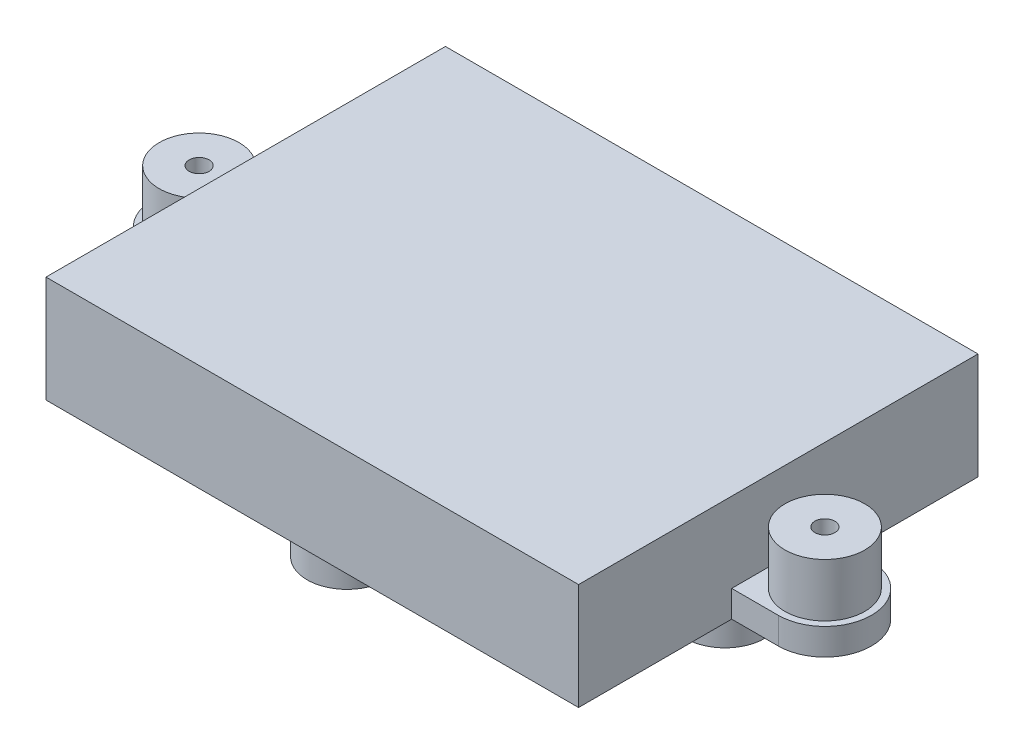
from build123d import *

# Parameters (mm, degrees)
ESQUISSE1_W                  = 56
ESQUISSE1_H                  = 8
PRISME_DE_BASE_DEPTH         = 15
ESQUISSE2_W                  = 30
ESQUISSE2_H                  = 6
EPAULEMENT_DEPTH             = 8
ESQUISSE3_R                  = 3
BOSSAGE_DEPTH                = 4
ESQUISSE4_R                  = 0.75
PASSAGE_DEPTH                = 33.32645975
SYM_TRIE2_COPY_1_SKETCH_R    = 3
SYM_TRIE2_COPY_1_DEPTH       = 4
SYM_TRIE2_COPY_2_SKETCH_R    = 0.75
SYM_TRIE2_COPY_2_DEPTH       = 33.32645975
ESQUISSE5_R                  = 12
EXTRUSION2_DEPTH             = 2
ESQUISSE6_R                  = 3
EXTRUSION3_DEPTH             = 3.5
R_P_TITION_CIRCULAIRE1_COUNT = 3
ENL_V_MAT_EXTRU_1_DEPTH      = 33.32645975


with BuildPart() as part:
    # Esquisse1 → Prisme de base (new, symmetric)
    with BuildSketch(Plane.XY):
        Rectangle(ESQUISSE1_W, ESQUISSE1_H)
    extrude(amount=PRISME_DE_BASE_DEPTH, both=True)

    # Esquisse2 → Epaulement (cut)
    with BuildSketch(Plane(origin=(28, 0, 0), x_dir=(0, 0, -1), z_dir=(1, 0, 0))):
        with Locations((0, 1)):
            Rectangle(ESQUISSE2_W, ESQUISSE2_H)
    epaulement = extrude(amount=-EPAULEMENT_DEPTH, mode=Mode.SUBTRACT)

    # Esquisse3 → Bossage (add)
    with BuildSketch(Plane(origin=(0, -2, 0), x_dir=(-1, 0, 0), z_dir=(0, 1, 0))):
        with Locations(Location((-23.5, 0, 0), (0, 0, 270))):
            Circle(ESQUISSE3_R)
    bossage = extrude(amount=BOSSAGE_DEPTH)

    # Esquisse4 → Passage (cut, through all)
    with BuildSketch(Plane(origin=(0, 2, 0), x_dir=(-1, 0, 0), z_dir=(0, 1, 0))):
        with Locations(Location((-23.5, 0, 0), (0, 0, 90))):
            Circle(ESQUISSE4_R)
    passage = extrude(amount=-PASSAGE_DEPTH, mode=Mode.SUBTRACT)

    # Sym_trie1: Bossage, Passage across plane
    add(bossage.mirror(Plane.XY))
    add(passage.mirror(Plane.XY), mode=Mode.SUBTRACT)

    # Sym_trie2: Epaulement, Bossage, Passage across plane
    add(epaulement.mirror(Plane(origin=(0, 0, 0), x_dir=(0, 0, 1), z_dir=(1, 0, 0))), mode=Mode.SUBTRACT)
    add(bossage.mirror(Plane(origin=(0, 0, 0), x_dir=(0, 0, 1), z_dir=(1, 0, 0))))
    add(passage.mirror(Plane(origin=(0, 0, 0), x_dir=(0, 0, 1), z_dir=(1, 0, 0))), mode=Mode.SUBTRACT)

    # Sym_trie2 copy 1 sketch → Sym_trie2 copy 1 (add)
    with BuildSketch(Plane(origin=(0, -2, 0), x_dir=(1, 0, 0), z_dir=(0, 1, 0))):
        with Locations(Location((-23.5, 0, 0), (0, 0, 270))):
            Circle(SYM_TRIE2_COPY_1_SKETCH_R)
    extrude(amount=SYM_TRIE2_COPY_1_DEPTH)

    # Sym_trie2 copy 2 sketch → Sym_trie2 copy 2 (cut, through all)
    with BuildSketch(Plane(origin=(0, 2, 0), x_dir=(1, 0, 0), z_dir=(0, 1, 0))):
        with Locations(Location((-23.5, 0, 0), (0, 0, 90))):
            Circle(SYM_TRIE2_COPY_2_SKETCH_R)
    extrude(amount=-SYM_TRIE2_COPY_2_DEPTH, mode=Mode.SUBTRACT)

    # Esquisse5 → Extrusion2 (add)
    with BuildSketch(Plane.XZ.offset(4)):
        with Locations(Location((4, 0, 0), (0, 0, 90))):
            Circle(ESQUISSE5_R)
    extrude(amount=EXTRUSION2_DEPTH)

    # Esquisse6 → Extrusion3 (add)
    with BuildSketch(Plane.XZ.offset(4)):
        with Locations(Location((16, 0, 0), (0, 0, 97.180755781))):
            Circle(ESQUISSE6_R)
    extrusion3 = extrude(amount=EXTRUSION3_DEPTH)

    # R_p_tition circulaire1: Extrusion3 ×3 about axis
    r_p_tition_circulaire1_axis = Axis((4, 0, 0), (0, 1, 0))
    for i in range(1, R_P_TITION_CIRCULAIRE1_COUNT):
        add(extrusion3.rotate(r_p_tition_circulaire1_axis, i * 360 / R_P_TITION_CIRCULAIRE1_COUNT))

    # Esquisse7 → Enl_v. mat.-Extru.1 (cut, through all)
    with BuildSketch(Plane(origin=(0, -2, 0), x_dir=(-1, 0, 0), z_dir=(0, 1, 0))):
        with BuildLine():
            Line((-20, -3.5), (-23.5, -3.5))
            ThreePointArc((-23.5, -3.5), (-27, 0), (-23.5, 3.5))
            Line((-23.5, 3.5), (-20, 3.5))
            Line((-20, 3.5), (-20, 15))
            Line((-20, 15), (-28, 15))
            Line((-28, 15), (-28, -15))
            Line((-28, -15), (-20, -15))
            Line((-20, -15), (-20, -3.5))
        make_face()
    enl_v_mat_extru_1 = extrude(amount=-ENL_V_MAT_EXTRU_1_DEPTH, mode=Mode.SUBTRACT)

    # Sym_trie3: Enl_v. mat.-Extru.1 across plane
    add(enl_v_mat_extru_1.mirror(Plane(origin=(0, 0, 0), x_dir=(0, 0, 1), z_dir=(1, 0, 0))), mode=Mode.SUBTRACT)


solid = part.part
